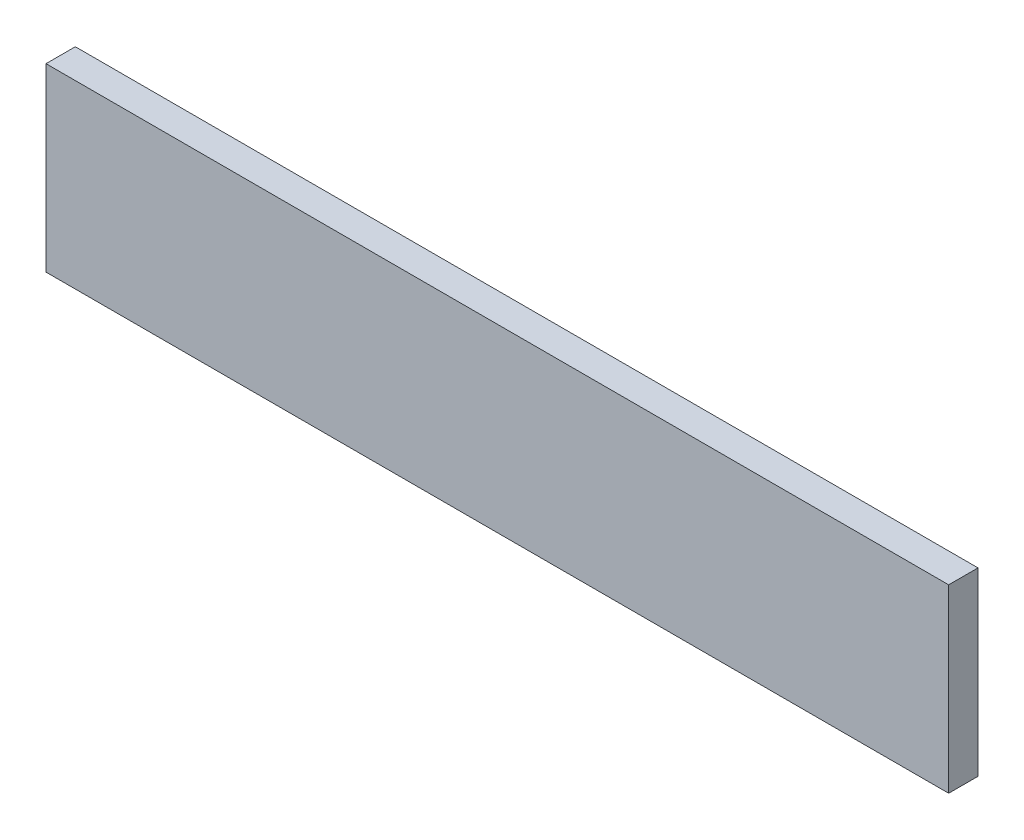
ISO-10303-21;
HEADER;
FILE_DESCRIPTION(('STEP AP214'),'2;1');
FILE_NAME('part.step','',(''),(''),'','','');
FILE_SCHEMA(('AUTOMOTIVE_DESIGN { 1 0 10303 214 1 1 1 1 }'));
ENDSEC;
DATA;
#1=APPLICATION_CONTEXT('core data for automotive mechanical design processes');
#2=APPLICATION_PROTOCOL_DEFINITION('international standard','automotive_design',2000,#1);
#3=PRODUCT_CONTEXT('',#1,'mechanical');
#4=PRODUCT('Part','Part','',(#3));
#5=PRODUCT_RELATED_PRODUCT_CATEGORY('part','',(#4));
#6=PRODUCT_DEFINITION_FORMATION('','',#4);
#7=PRODUCT_DEFINITION_CONTEXT('part definition',#1,'design');
#8=PRODUCT_DEFINITION('design','',#6,#7);
#9=PRODUCT_DEFINITION_SHAPE('','',#8);
#10=(LENGTH_UNIT() NAMED_UNIT(*) SI_UNIT(.MILLI.,.METRE.));
#11=(NAMED_UNIT(*) PLANE_ANGLE_UNIT() SI_UNIT($,.RADIAN.));
#12=(NAMED_UNIT(*) SI_UNIT($,.STERADIAN.) SOLID_ANGLE_UNIT());
#13=UNCERTAINTY_MEASURE_WITH_UNIT(LENGTH_MEASURE(1.E-05),#10,'distance_accuracy_value','');
#14=(GEOMETRIC_REPRESENTATION_CONTEXT(3) GLOBAL_UNCERTAINTY_ASSIGNED_CONTEXT((#13)) GLOBAL_UNIT_ASSIGNED_CONTEXT((#10,
#11,#12)) REPRESENTATION_CONTEXT('',''));
#15=CARTESIAN_POINT('',(0.,0.,0.));
#16=DIRECTION('',(0.,0.,1.));
#17=DIRECTION('',(1.,0.,0.));
#18=AXIS2_PLACEMENT_3D('',#15,#16,#17);
#19=CARTESIAN_POINT('',(-127.,25.4,8.255));
#20=DIRECTION('',(0.,-1.,0.));
#21=DIRECTION('',(1.,0.,0.));
#22=AXIS2_PLACEMENT_3D('',#19,#20,#21);
#23=PLANE('',#22);
#24=DIRECTION('',(-1.,0.,0.));
#25=VECTOR('',#24,1.);
#26=CARTESIAN_POINT('',(-127.,25.4,0.));
#27=LINE('',#26,#25);
#28=CARTESIAN_POINT('',(127.,25.4,0.));
#29=VERTEX_POINT('',#28);
#30=CARTESIAN_POINT('',(-127.,25.4,0.));
#31=VERTEX_POINT('',#30);
#32=EDGE_CURVE('E111',#29,#31,#27,.T.);
#33=ORIENTED_EDGE('',*,*,#32,.T.);
#34=DIRECTION('',(0.,0.,-1.));
#35=VECTOR('',#34,1.);
#36=CARTESIAN_POINT('',(-127.,25.4,8.255));
#37=LINE('',#36,#35);
#38=CARTESIAN_POINT('',(-127.,25.4,8.255));
#39=VERTEX_POINT('',#38);
#40=EDGE_CURVE('E11',#39,#31,#37,.T.);
#41=ORIENTED_EDGE('',*,*,#40,.F.);
#42=DIRECTION('',(-1.,0.,0.));
#43=VECTOR('',#42,1.);
#44=CARTESIAN_POINT('',(-127.,25.4,8.255));
#45=LINE('',#44,#43);
#46=CARTESIAN_POINT('',(127.,25.4,8.255));
#47=VERTEX_POINT('',#46);
#48=EDGE_CURVE('E100',#47,#39,#45,.T.);
#49=ORIENTED_EDGE('',*,*,#48,.F.);
#50=DIRECTION('',(0.,0.,-1.));
#51=VECTOR('',#50,1.);
#52=CARTESIAN_POINT('',(127.,25.4,8.255));
#53=LINE('',#52,#51);
#54=EDGE_CURVE('E108',#47,#29,#53,.T.);
#55=ORIENTED_EDGE('',*,*,#54,.T.);
#56=EDGE_LOOP('',(#33,#41,#49,#55));
#57=FACE_BOUND('',#56,.T.);
#58=ADVANCED_FACE('F44',(#57),#23,.F.);
#59=CARTESIAN_POINT('',(-127.,-25.4,8.255));
#60=DIRECTION('',(1.,0.,0.));
#61=DIRECTION('',(0.,0.,-1.));
#62=AXIS2_PLACEMENT_3D('',#59,#60,#61);
#63=PLANE('',#62);
#64=DIRECTION('',(0.,-1.,0.));
#65=VECTOR('',#64,1.);
#66=CARTESIAN_POINT('',(-127.,-25.4,0.));
#67=LINE('',#66,#65);
#68=CARTESIAN_POINT('',(-127.,-25.4,0.));
#69=VERTEX_POINT('',#68);
#70=EDGE_CURVE('E105',#31,#69,#67,.T.);
#71=ORIENTED_EDGE('',*,*,#70,.T.);
#72=DIRECTION('',(0.,0.,-1.));
#73=VECTOR('',#72,1.);
#74=CARTESIAN_POINT('',(-127.,-25.4,8.255));
#75=LINE('',#74,#73);
#76=CARTESIAN_POINT('',(-127.,-25.4,8.255));
#77=VERTEX_POINT('',#76);
#78=EDGE_CURVE('E53',#77,#69,#75,.T.);
#79=ORIENTED_EDGE('',*,*,#78,.F.);
#80=DIRECTION('',(0.,-1.,0.));
#81=VECTOR('',#80,1.);
#82=CARTESIAN_POINT('',(-127.,-25.4,8.255));
#83=LINE('',#82,#81);
#84=EDGE_CURVE('E95',#39,#77,#83,.T.);
#85=ORIENTED_EDGE('',*,*,#84,.F.);
#86=ORIENTED_EDGE('',*,*,#40,.T.);
#87=EDGE_LOOP('',(#71,#79,#85,#86));
#88=FACE_BOUND('',#87,.T.);
#89=ADVANCED_FACE('F102',(#88),#63,.F.);
#90=CARTESIAN_POINT('',(-127.,-25.4,8.255));
#91=DIRECTION('',(0.,1.,0.));
#92=DIRECTION('',(-1.,0.,0.));
#93=AXIS2_PLACEMENT_3D('',#90,#91,#92);
#94=PLANE('',#93);
#95=DIRECTION('',(1.,0.,0.));
#96=VECTOR('',#95,1.);
#97=CARTESIAN_POINT('',(-127.,-25.4,0.));
#98=LINE('',#97,#96);
#99=CARTESIAN_POINT('',(127.,-25.4,0.));
#100=VERTEX_POINT('',#99);
#101=EDGE_CURVE('E80',#69,#100,#98,.T.);
#102=ORIENTED_EDGE('',*,*,#101,.T.);
#103=DIRECTION('',(0.,0.,-1.));
#104=VECTOR('',#103,1.);
#105=CARTESIAN_POINT('',(127.,-25.4,8.255));
#106=LINE('',#105,#104);
#107=CARTESIAN_POINT('',(127.,-25.4,8.255));
#108=VERTEX_POINT('',#107);
#109=EDGE_CURVE('E101',#108,#100,#106,.T.);
#110=ORIENTED_EDGE('',*,*,#109,.F.);
#111=DIRECTION('',(1.,0.,0.));
#112=VECTOR('',#111,1.);
#113=CARTESIAN_POINT('',(-127.,-25.4,8.255));
#114=LINE('',#113,#112);
#115=EDGE_CURVE('E94',#77,#108,#114,.T.);
#116=ORIENTED_EDGE('',*,*,#115,.F.);
#117=ORIENTED_EDGE('',*,*,#78,.T.);
#118=EDGE_LOOP('',(#102,#110,#116,#117));
#119=FACE_BOUND('',#118,.T.);
#120=ADVANCED_FACE('F103',(#119),#94,.F.);
#121=CARTESIAN_POINT('',(127.,-25.4,8.255));
#122=DIRECTION('',(-1.,0.,0.));
#123=DIRECTION('',(0.,0.,1.));
#124=AXIS2_PLACEMENT_3D('',#121,#122,#123);
#125=PLANE('',#124);
#126=DIRECTION('',(0.,1.,0.));
#127=VECTOR('',#126,1.);
#128=CARTESIAN_POINT('',(127.,-25.4,0.));
#129=LINE('',#128,#127);
#130=EDGE_CURVE('E82',#100,#29,#129,.T.);
#131=ORIENTED_EDGE('',*,*,#130,.T.);
#132=ORIENTED_EDGE('',*,*,#54,.F.);
#133=DIRECTION('',(0.,1.,0.));
#134=VECTOR('',#133,1.);
#135=CARTESIAN_POINT('',(127.,-25.4,8.255));
#136=LINE('',#135,#134);
#137=EDGE_CURVE('E62',#108,#47,#136,.T.);
#138=ORIENTED_EDGE('',*,*,#137,.F.);
#139=ORIENTED_EDGE('',*,*,#109,.T.);
#140=EDGE_LOOP('',(#131,#132,#138,#139));
#141=FACE_BOUND('',#140,.T.);
#142=ADVANCED_FACE('F128',(#141),#125,.F.);
#143=CARTESIAN_POINT('',(0.,0.,8.255));
#144=DIRECTION('',(0.,0.,1.));
#145=DIRECTION('',(1.,0.,0.));
#146=AXIS2_PLACEMENT_3D('',#143,#144,#145);
#147=PLANE('',#146);
#148=ORIENTED_EDGE('',*,*,#48,.T.);
#149=ORIENTED_EDGE('',*,*,#84,.T.);
#150=ORIENTED_EDGE('',*,*,#115,.T.);
#151=ORIENTED_EDGE('',*,*,#137,.T.);
#152=EDGE_LOOP('',(#148,#149,#150,#151));
#153=FACE_BOUND('',#152,.T.);
#154=ADVANCED_FACE('F93',(#153),#147,.T.);
#155=CARTESIAN_POINT('',(0.,0.,0.));
#156=DIRECTION('',(0.,0.,1.));
#157=DIRECTION('',(1.,0.,0.));
#158=AXIS2_PLACEMENT_3D('',#155,#156,#157);
#159=PLANE('',#158);
#160=ORIENTED_EDGE('',*,*,#32,.F.);
#161=ORIENTED_EDGE('',*,*,#130,.F.);
#162=ORIENTED_EDGE('',*,*,#101,.F.);
#163=ORIENTED_EDGE('',*,*,#70,.F.);
#164=EDGE_LOOP('',(#160,#161,#162,#163));
#165=FACE_BOUND('',#164,.T.);
#166=ADVANCED_FACE('F129',(#165),#159,.F.);
#167=CLOSED_SHELL('',(#58,#89,#120,#142,#154,#166));
#168=MANIFOLD_SOLID_BREP('B2',#167);
#169=ADVANCED_BREP_SHAPE_REPRESENTATION('',(#18,#168),#14);
#170=SHAPE_DEFINITION_REPRESENTATION(#9,#169);
ENDSEC;
END-ISO-10303-21;
